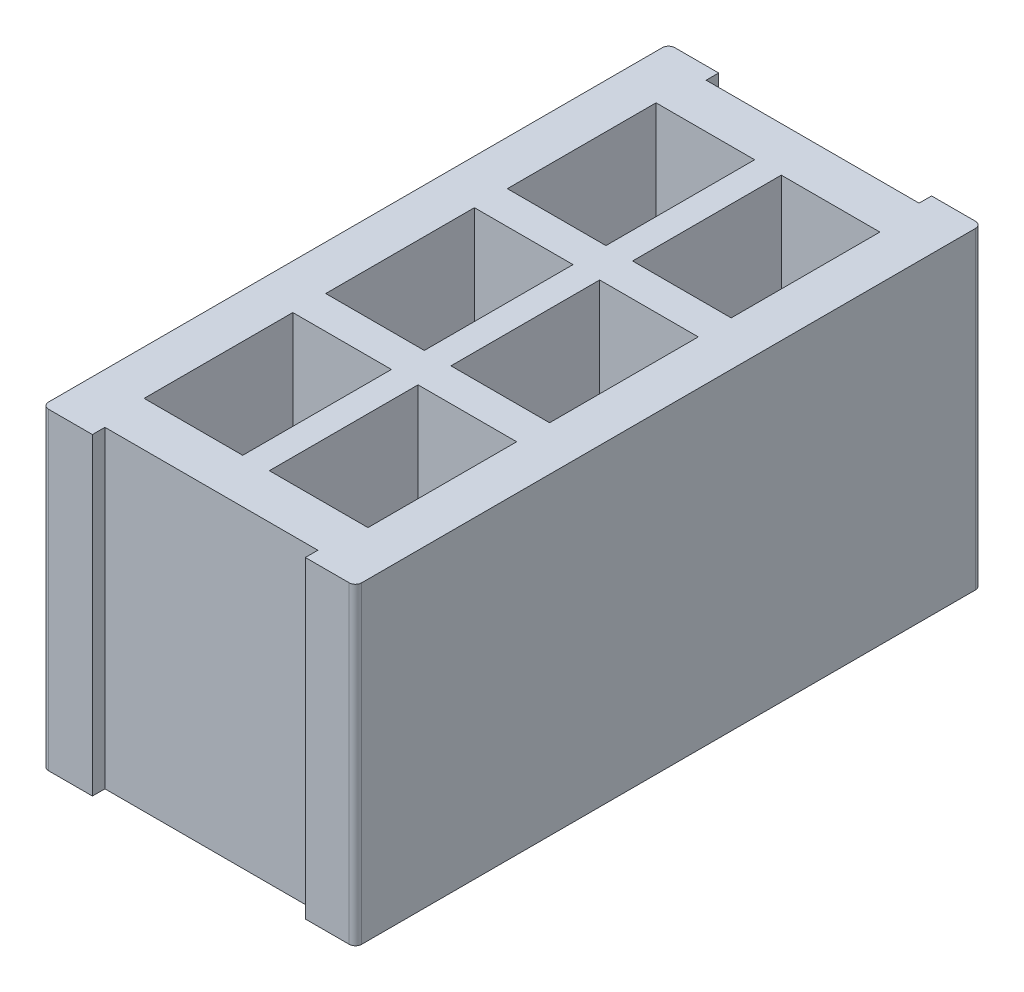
from build123d import *

# Parameters (mm, degrees)
EXTRUSION1_DEPTH                  = 25
ESQUISSE2_W                       = 7
ESQUISSE2_H                       = 11
ENL_V_MAT_EXTRU_1_DEPTH           = 25
ENL_V_MAT_EXTRU_1_DRAFT           = 1
ENL_V_MAT_EXTRU_1_PROFILE_2_DEPTH = 25
ENL_V_MAT_EXTRU_1_PROFILE_2_DRAFT = 1
ENL_V_MAT_EXTRU_1_PROFILE_3_DEPTH = 25
ENL_V_MAT_EXTRU_1_PROFILE_3_DRAFT = 1
ENL_V_MAT_EXTRU_1_PROFILE_4_DEPTH = 25
ENL_V_MAT_EXTRU_1_PROFILE_4_DRAFT = 1
ENL_V_MAT_EXTRU_1_PROFILE_5_DEPTH = 25
ENL_V_MAT_EXTRU_1_PROFILE_5_DRAFT = 1
ENL_V_MAT_EXTRU_1_PROFILE_6_DEPTH = 25
ENL_V_MAT_EXTRU_1_PROFILE_6_DRAFT = 1


with BuildPart() as part:
    # Esquisse1 → Extrusion1 (new body)
    with BuildSketch(Plane(origin=(0, 0, 0), x_dir=(1, 0, 0), z_dir=(0, 1, 0))):
        with BuildLine():
            Line((21, 0), (24.5, 0))
            ThreePointArc((24.5, 0), (24.853553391, 0.146446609), (25, 0.5))
            Line((25, 0.5), (25, 49.5))
            ThreePointArc((25, 49.5), (24.853553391, 49.853553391), (24.5, 50))
            Line((24.5, 50), (21, 50))
            Line((21, 50), (21, 49))
            Line((21, 49), (4, 49))
            Line((4, 49), (4, 50))
            Line((4, 50), (0.5, 50))
            ThreePointArc((0.5, 50), (0.146446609, 49.853553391), (0, 49.5))
            Line((0, 49.5), (0, 0.5))
            ThreePointArc((0, 0.5), (0.146446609, 0.146446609), (0.5, 0))
            Line((0.5, 0), (4, 0))
            Line((4, 0), (4, 1))
            Line((4, 1), (21, 1))
            Line((21, 1), (21, 0))
        make_face()
    extrude(amount=EXTRUSION1_DEPTH)


with BuildPart() as enl_v_mat_extru_1_tool:
    # Esquisse2 → Enl_v. mat.-Extru.1 (with draft: the straight prism first)
    with BuildSketch(Plane.XZ):
        with Locations((17.5, -10.5)):
            Rectangle(ESQUISSE2_W, ESQUISSE2_H)
    extrude(amount=-ENL_V_MAT_EXTRU_1_DEPTH)
    # Enl_v. mat.-Extru.1: the draft: its side faces are tilted about the plane it starts from
    enl_v_mat_extru_1_sides = [enl_v_mat_extru_1_tool.faces().sort_by_distance(p)[0] for p in [
        (17.5, 12.5, -16),
        (21, 12.5, -10.5),
        (17.5, 12.5, -5),
        (14, 12.5, -10.5),
    ]]
    draft(enl_v_mat_extru_1_sides, Plane.XZ, ENL_V_MAT_EXTRU_1_DRAFT)


with BuildPart() as part_1:
    add(part.part)

    # Enl_v. mat.-Extru.1: cut by enl_v_mat_extru_1_tool
    add(enl_v_mat_extru_1_tool.part, mode=Mode.SUBTRACT)


with BuildPart() as enl_v_mat_extru_1_profile_2_tool:
    # Esquisse2 → Enl_v. mat.-Extru.1 profile 2 (with draft: the straight prism first)
    with BuildSketch(Plane.XZ):
        with Locations((7.5, -39.5)):
            Rectangle(ESQUISSE2_W, ESQUISSE2_H)
    extrude(amount=-ENL_V_MAT_EXTRU_1_PROFILE_2_DEPTH)
    # Enl_v. mat.-Extru.1 profile 2: the draft: its side faces are tilted about the plane it starts from
    enl_v_mat_extru_1_profile_2_sides = [enl_v_mat_extru_1_profile_2_tool.faces().sort_by_distance(p)[0] for p in [
        (7.5, 12.5, -45),
        (11, 12.5, -39.5),
        (7.5, 12.5, -34),
        (4, 12.5, -39.5),
    ]]
    draft(enl_v_mat_extru_1_profile_2_sides, Plane.XZ, ENL_V_MAT_EXTRU_1_PROFILE_2_DRAFT)


with BuildPart() as part_2:
    add(part_1.part)

    # Enl_v. mat.-Extru.1 profile 2: cut by enl_v_mat_extru_1_profile_2_tool
    add(enl_v_mat_extru_1_profile_2_tool.part, mode=Mode.SUBTRACT)


with BuildPart() as enl_v_mat_extru_1_profile_3_tool:
    # Esquisse2 → Enl_v. mat.-Extru.1 profile 3 (with draft: the straight prism first)
    with BuildSketch(Plane.XZ):
        with Locations((7.5, -25)):
            Rectangle(ESQUISSE2_W, ESQUISSE2_H)
    extrude(amount=-ENL_V_MAT_EXTRU_1_PROFILE_3_DEPTH)
    # Enl_v. mat.-Extru.1 profile 3: the draft: its side faces are tilted about the plane it starts from
    enl_v_mat_extru_1_profile_3_sides = [enl_v_mat_extru_1_profile_3_tool.faces().sort_by_distance(p)[0] for p in [
        (7.5, 12.5, -30.5),
        (11, 12.5, -25),
        (7.5, 12.5, -19.5),
        (4, 12.5, -25),
    ]]
    draft(enl_v_mat_extru_1_profile_3_sides, Plane.XZ, ENL_V_MAT_EXTRU_1_PROFILE_3_DRAFT)


with BuildPart() as part_3:
    add(part_2.part)

    # Enl_v. mat.-Extru.1 profile 3: cut by enl_v_mat_extru_1_profile_3_tool
    add(enl_v_mat_extru_1_profile_3_tool.part, mode=Mode.SUBTRACT)


with BuildPart() as enl_v_mat_extru_1_profile_4_tool:
    # Esquisse2 → Enl_v. mat.-Extru.1 profile 4 (with draft: the straight prism first)
    with BuildSketch(Plane.XZ):
        with Locations((7.5, -10.5)):
            Rectangle(ESQUISSE2_W, ESQUISSE2_H)
    extrude(amount=-ENL_V_MAT_EXTRU_1_PROFILE_4_DEPTH)
    # Enl_v. mat.-Extru.1 profile 4: the draft: its side faces are tilted about the plane it starts from
    enl_v_mat_extru_1_profile_4_sides = [enl_v_mat_extru_1_profile_4_tool.faces().sort_by_distance(p)[0] for p in [
        (7.5, 12.5, -16),
        (11, 12.5, -10.5),
        (7.5, 12.5, -5),
        (4, 12.5, -10.5),
    ]]
    draft(enl_v_mat_extru_1_profile_4_sides, Plane.XZ, ENL_V_MAT_EXTRU_1_PROFILE_4_DRAFT)


with BuildPart() as part_4:
    add(part_3.part)

    # Enl_v. mat.-Extru.1 profile 4: cut by enl_v_mat_extru_1_profile_4_tool
    add(enl_v_mat_extru_1_profile_4_tool.part, mode=Mode.SUBTRACT)


with BuildPart() as enl_v_mat_extru_1_profile_5_tool:
    # Esquisse2 → Enl_v. mat.-Extru.1 profile 5 (with draft: the straight prism first)
    with BuildSketch(Plane.XZ):
        with Locations((17.5, -25)):
            Rectangle(ESQUISSE2_W, ESQUISSE2_H)
    extrude(amount=-ENL_V_MAT_EXTRU_1_PROFILE_5_DEPTH)
    # Enl_v. mat.-Extru.1 profile 5: the draft: its side faces are tilted about the plane it starts from
    enl_v_mat_extru_1_profile_5_sides = [enl_v_mat_extru_1_profile_5_tool.faces().sort_by_distance(p)[0] for p in [
        (17.5, 12.5, -30.5),
        (21, 12.5, -25),
        (17.5, 12.5, -19.5),
        (14, 12.5, -25),
    ]]
    draft(enl_v_mat_extru_1_profile_5_sides, Plane.XZ, ENL_V_MAT_EXTRU_1_PROFILE_5_DRAFT)


with BuildPart() as part_5:
    add(part_4.part)

    # Enl_v. mat.-Extru.1 profile 5: cut by enl_v_mat_extru_1_profile_5_tool
    add(enl_v_mat_extru_1_profile_5_tool.part, mode=Mode.SUBTRACT)


with BuildPart() as enl_v_mat_extru_1_profile_6_tool:
    # Esquisse2 → Enl_v. mat.-Extru.1 profile 6 (with draft: the straight prism first)
    with BuildSketch(Plane.XZ):
        with Locations((17.5, -39.5)):
            Rectangle(ESQUISSE2_W, ESQUISSE2_H)
    extrude(amount=-ENL_V_MAT_EXTRU_1_PROFILE_6_DEPTH)
    # Enl_v. mat.-Extru.1 profile 6: the draft: its side faces are tilted about the plane it starts from
    enl_v_mat_extru_1_profile_6_sides = [enl_v_mat_extru_1_profile_6_tool.faces().sort_by_distance(p)[0] for p in [
        (17.5, 12.5, -45),
        (21, 12.5, -39.5),
        (17.5, 12.5, -34),
        (14, 12.5, -39.5),
    ]]
    draft(enl_v_mat_extru_1_profile_6_sides, Plane.XZ, ENL_V_MAT_EXTRU_1_PROFILE_6_DRAFT)


with BuildPart() as part_6:
    add(part_5.part)

    # Enl_v. mat.-Extru.1 profile 6: cut by enl_v_mat_extru_1_profile_6_tool
    add(enl_v_mat_extru_1_profile_6_tool.part, mode=Mode.SUBTRACT)


solid = part_6.part
